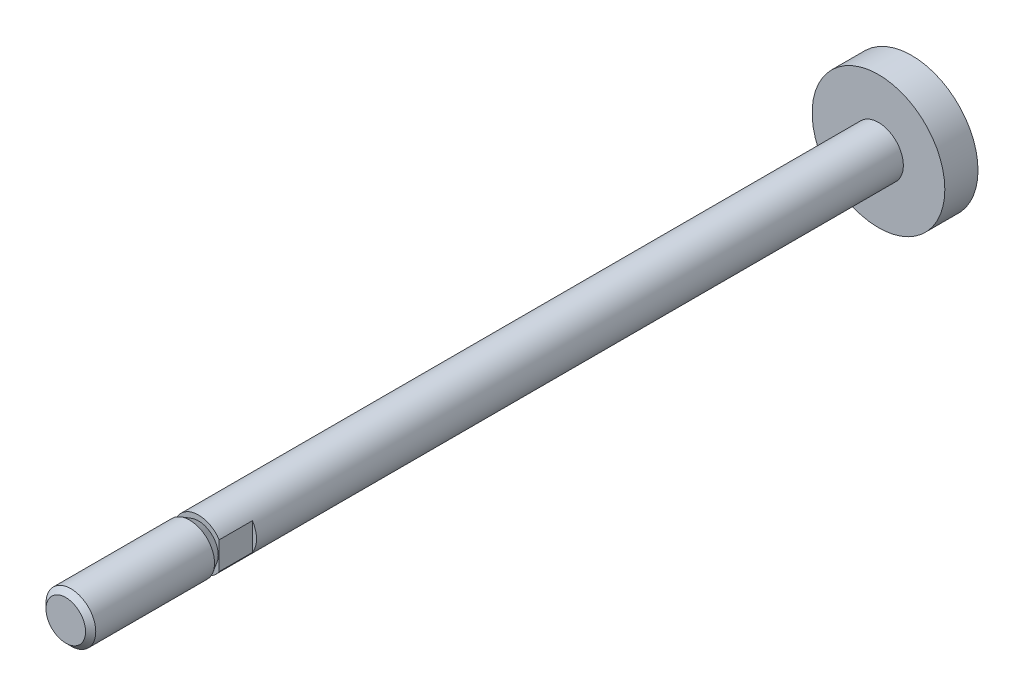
from build123d import *

# Parameters (mm, degrees)
LINEAR_AUSTRAGEN1_DEPTH      = 16
LINEAR_AUSTRAGEN1_DEPTH_BACK = 16
SKIZZE2_W                    = 8
SKIZZE2_H                    = 4
LINEAR_AUSTRAGEN2_DEPTH      = 16
LINEAR_AUSTRAGEN2_DEPTH_BACK = 16
SKIZZE3_W                    = 8
SKIZZE3_H                    = 4


with BuildPart() as part:
    # Skizze1 → Rotation1 (revolve)
    with BuildSketch(Plane(origin=(0, 0, 0), x_dir=(0, 0, -1), z_dir=(1, 0, 0)), mode=Mode.PRIVATE) as rotation1_sk:
        Polygon((-38, 0), (-38, 2.3865), (-37.3865, 3), (-23.06261317, 3), (-22, 2.3865), (-22, 3), (60, 3), (60, 8), (64, 8), (64, 0), align=None)
    revolve(rotation1_sk.sketch.rotate(Axis((0, 0, -64), (0, 0, 1)), 270), axis=Axis((0, 0, -64), (0, 0, 1)))

    # Skizze2 → Linear austragen1 (cut, two sides: drawn at the far end of the back side and taken through both)
    with BuildSketch(Plane(origin=(0, 0, 0), x_dir=(-1, 0, 0), z_dir=(0, 1, 0)).offset(-LINEAR_AUSTRAGEN1_DEPTH_BACK)):
        with Locations((-6.5, 20)):
            Rectangle(SKIZZE2_W, SKIZZE2_H)
    extrude(amount=LINEAR_AUSTRAGEN1_DEPTH + LINEAR_AUSTRAGEN1_DEPTH_BACK, mode=Mode.SUBTRACT)

    # Skizze3 → Linear austragen2 (cut, two sides: drawn at the far end of the back side and taken through both)
    with BuildSketch(Plane(origin=(0, 0, 0), x_dir=(-1, 0, 0), z_dir=(0, 1, 0)).offset(-LINEAR_AUSTRAGEN2_DEPTH_BACK)):
        with Locations((6.5, 20)):
            Rectangle(SKIZZE3_W, SKIZZE3_H)
    extrude(amount=LINEAR_AUSTRAGEN2_DEPTH + LINEAR_AUSTRAGEN2_DEPTH_BACK, mode=Mode.SUBTRACT)


solid = part.part
